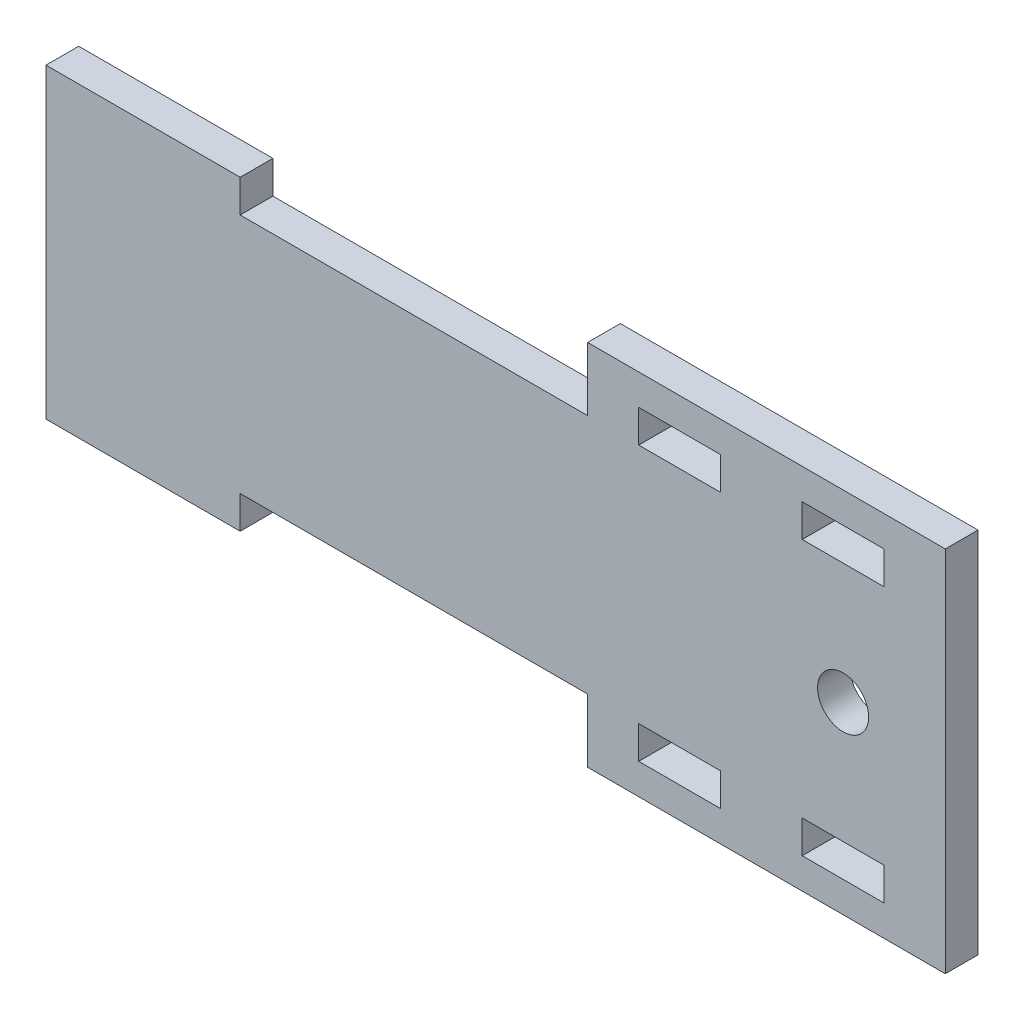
from build123d import *

# Parameters (mm, degrees)
ESQUISSE1_R        = 2.5
ESQUISSE1_W        = 8
ESQUISSE1_H        = 3.2
BOSS_EXTRU_1_DEPTH = 3.2


with BuildPart() as part:
    # Esquisse1 → Boss.-Extru.1 (new body)
    with BuildSketch(Plane.XY):
        Polygon((-25, 18), (10, 18), (10, -18), (-25, -18), (-25, -12), (-25.004426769, -11.8), (-58.997142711, -11.8), (-58.997142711, -15), (-77.997142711, -15), (-77.997142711, 11.8), (-77.997142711, 15), (-58.997142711, 15), (-58.997142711, 11.8), (-25.004426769, 11.8), (-25, 12), align=None)
        Circle(ESQUISSE1_R, mode=Mode.SUBTRACT)
        with Locations((0, -13.4)):
            Rectangle(ESQUISSE1_W, ESQUISSE1_H, mode=Mode.SUBTRACT)
        with Locations((-16, -13.4)):
            Rectangle(ESQUISSE1_W, ESQUISSE1_H, mode=Mode.SUBTRACT)
        with Locations((0, 13.4)):
            Rectangle(ESQUISSE1_W, ESQUISSE1_H, mode=Mode.SUBTRACT)
        with Locations((-16, 13.4)):
            Rectangle(ESQUISSE1_W, ESQUISSE1_H, mode=Mode.SUBTRACT)
    extrude(amount=BOSS_EXTRU_1_DEPTH)


solid = part.part
